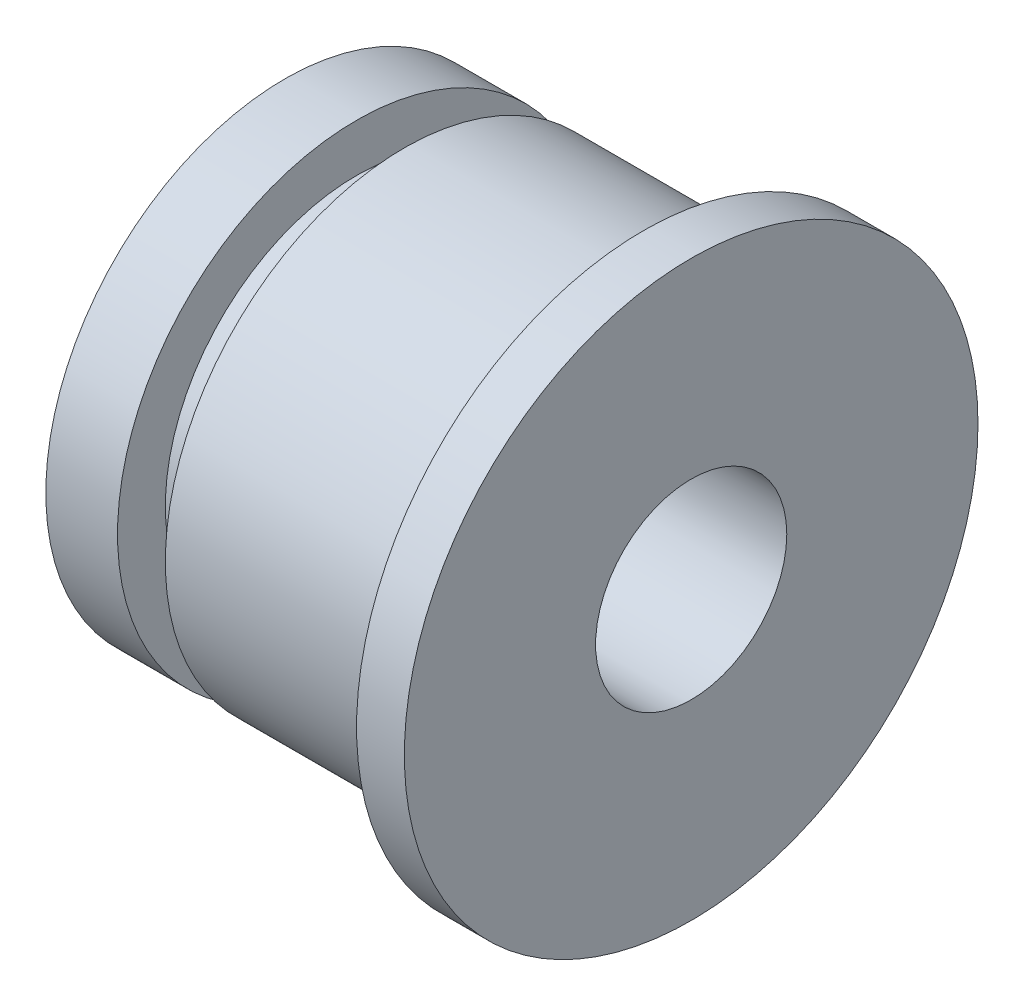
ISO-10303-21;
HEADER;
FILE_DESCRIPTION(('STEP AP214'),'2;1');
FILE_NAME('part.step','',(''),(''),'','','');
FILE_SCHEMA(('AUTOMOTIVE_DESIGN { 1 0 10303 214 1 1 1 1 }'));
ENDSEC;
DATA;
#1=APPLICATION_CONTEXT('core data for automotive mechanical design processes');
#2=APPLICATION_PROTOCOL_DEFINITION('international standard','automotive_design',2000,#1);
#3=PRODUCT_CONTEXT('',#1,'mechanical');
#4=PRODUCT('Part','Part','',(#3));
#5=PRODUCT_RELATED_PRODUCT_CATEGORY('part','',(#4));
#6=PRODUCT_DEFINITION_FORMATION('','',#4);
#7=PRODUCT_DEFINITION_CONTEXT('part definition',#1,'design');
#8=PRODUCT_DEFINITION('design','',#6,#7);
#9=PRODUCT_DEFINITION_SHAPE('','',#8);
#10=(LENGTH_UNIT() NAMED_UNIT(*) SI_UNIT(.MILLI.,.METRE.));
#11=(NAMED_UNIT(*) PLANE_ANGLE_UNIT() SI_UNIT($,.RADIAN.));
#12=(NAMED_UNIT(*) SI_UNIT($,.STERADIAN.) SOLID_ANGLE_UNIT());
#13=UNCERTAINTY_MEASURE_WITH_UNIT(LENGTH_MEASURE(1.E-05),#10,'distance_accuracy_value','');
#14=(GEOMETRIC_REPRESENTATION_CONTEXT(3) GLOBAL_UNCERTAINTY_ASSIGNED_CONTEXT((#13)) GLOBAL_UNIT_ASSIGNED_CONTEXT((#10,
#11,#12)) REPRESENTATION_CONTEXT('',''));
#15=CARTESIAN_POINT('',(0.,0.,0.));
#16=DIRECTION('',(0.,0.,1.));
#17=DIRECTION('',(1.,0.,0.));
#18=AXIS2_PLACEMENT_3D('',#15,#16,#17);
#19=CARTESIAN_POINT('',(11.5,-2.,0.));
#20=DIRECTION('',(1.,0.,0.));
#21=DIRECTION('',(0.,0.,-1.));
#22=AXIS2_PLACEMENT_3D('',#19,#20,#21);
#23=PLANE('',#22);
#24=CARTESIAN_POINT('',(11.5,0.,0.));
#25=DIRECTION('',(1.,0.,0.));
#26=DIRECTION('',(0.,0.,-1.));
#27=AXIS2_PLACEMENT_3D('',#24,#25,#26);
#28=CIRCLE('',#27,5.);
#29=CARTESIAN_POINT('',(11.5,0.,-5.));
#30=VERTEX_POINT('',#29);
#31=EDGE_CURVE('E10',#30,#30,#28,.T.);
#32=ORIENTED_EDGE('',*,*,#31,.F.);
#33=EDGE_LOOP('',(#32));
#34=FACE_BOUND('',#33,.T.);
#35=CARTESIAN_POINT('',(11.5,0.,0.));
#36=DIRECTION('',(1.,0.,0.));
#37=DIRECTION('',(0.,0.,-1.));
#38=AXIS2_PLACEMENT_3D('',#35,#36,#37);
#39=CIRCLE('',#38,2.);
#40=CARTESIAN_POINT('',(11.5,0.,-2.));
#41=VERTEX_POINT('',#40);
#42=EDGE_CURVE('E400',#41,#41,#39,.T.);
#43=ORIENTED_EDGE('',*,*,#42,.T.);
#44=EDGE_LOOP('',(#43));
#45=FACE_BOUND('',#44,.T.);
#46=ADVANCED_FACE('F366',(#34,#45),#23,.F.);
#47=CARTESIAN_POINT('',(23.,0.,0.));
#48=DIRECTION('',(1.,0.,0.));
#49=DIRECTION('',(0.,0.,-1.));
#50=AXIS2_PLACEMENT_3D('',#47,#48,#49);
#51=CYLINDRICAL_SURFACE('',#50,5.);
#52=CARTESIAN_POINT('',(13.,0.,0.));
#53=DIRECTION('',(1.,0.,0.));
#54=DIRECTION('',(0.,0.,-1.));
#55=AXIS2_PLACEMENT_3D('',#52,#53,#54);
#56=CIRCLE('',#55,5.);
#57=CARTESIAN_POINT('',(13.,0.,-5.));
#58=VERTEX_POINT('',#57);
#59=EDGE_CURVE('E372',#58,#58,#56,.T.);
#60=ORIENTED_EDGE('',*,*,#59,.F.);
#61=EDGE_LOOP('',(#60));
#62=FACE_BOUND('',#61,.T.);
#63=ORIENTED_EDGE('',*,*,#31,.T.);
#64=EDGE_LOOP('',(#63));
#65=FACE_BOUND('',#64,.T.);
#66=ADVANCED_FACE('F449',(#62,#65),#51,.T.);
#67=CARTESIAN_POINT('',(13.,-5.,0.));
#68=DIRECTION('',(-1.,0.,0.));
#69=DIRECTION('',(0.,0.,1.));
#70=AXIS2_PLACEMENT_3D('',#67,#68,#69);
#71=PLANE('',#70);
#72=CARTESIAN_POINT('',(13.,0.,0.));
#73=DIRECTION('',(1.,0.,0.));
#74=DIRECTION('',(0.,0.,-1.));
#75=AXIS2_PLACEMENT_3D('',#72,#73,#74);
#76=CIRCLE('',#75,4.);
#77=CARTESIAN_POINT('',(13.,0.,-4.));
#78=VERTEX_POINT('',#77);
#79=EDGE_CURVE('E376',#78,#78,#76,.T.);
#80=ORIENTED_EDGE('',*,*,#79,.F.);
#81=EDGE_LOOP('',(#80));
#82=FACE_BOUND('',#81,.T.);
#83=ORIENTED_EDGE('',*,*,#59,.T.);
#84=EDGE_LOOP('',(#83));
#85=FACE_BOUND('',#84,.T.);
#86=ADVANCED_FACE('F444',(#82,#85),#71,.F.);
#87=CARTESIAN_POINT('',(23.,0.,0.));
#88=DIRECTION('',(1.,0.,0.));
#89=DIRECTION('',(0.,0.,-1.));
#90=AXIS2_PLACEMENT_3D('',#87,#88,#89);
#91=CYLINDRICAL_SURFACE('',#90,4.);
#92=CARTESIAN_POINT('',(14.,0.,0.));
#93=DIRECTION('',(1.,0.,0.));
#94=DIRECTION('',(0.,0.,-1.));
#95=AXIS2_PLACEMENT_3D('',#92,#93,#94);
#96=CIRCLE('',#95,4.);
#97=CARTESIAN_POINT('',(14.,0.,-4.));
#98=VERTEX_POINT('',#97);
#99=EDGE_CURVE('E380',#98,#98,#96,.T.);
#100=ORIENTED_EDGE('',*,*,#99,.F.);
#101=EDGE_LOOP('',(#100));
#102=FACE_BOUND('',#101,.T.);
#103=ORIENTED_EDGE('',*,*,#79,.T.);
#104=EDGE_LOOP('',(#103));
#105=FACE_BOUND('',#104,.T.);
#106=ADVANCED_FACE('F438',(#102,#105),#91,.T.);
#107=CARTESIAN_POINT('',(14.,-4.,0.));
#108=DIRECTION('',(1.,0.,0.));
#109=DIRECTION('',(0.,0.,-1.));
#110=AXIS2_PLACEMENT_3D('',#107,#108,#109);
#111=PLANE('',#110);
#112=CARTESIAN_POINT('',(14.,0.,0.));
#113=DIRECTION('',(1.,0.,0.));
#114=DIRECTION('',(0.,0.,-1.));
#115=AXIS2_PLACEMENT_3D('',#112,#113,#114);
#116=CIRCLE('',#115,5.);
#117=CARTESIAN_POINT('',(14.,0.,-5.));
#118=VERTEX_POINT('',#117);
#119=EDGE_CURVE('E385',#118,#118,#116,.T.);
#120=ORIENTED_EDGE('',*,*,#119,.F.);
#121=EDGE_LOOP('',(#120));
#122=FACE_BOUND('',#121,.T.);
#123=ORIENTED_EDGE('',*,*,#99,.T.);
#124=EDGE_LOOP('',(#123));
#125=FACE_BOUND('',#124,.T.);
#126=ADVANCED_FACE('F432',(#122,#125),#111,.F.);
#127=CARTESIAN_POINT('',(23.,0.,0.));
#128=DIRECTION('',(1.,0.,0.));
#129=DIRECTION('',(0.,0.,-1.));
#130=AXIS2_PLACEMENT_3D('',#127,#128,#129);
#131=CYLINDRICAL_SURFACE('',#130,5.);
#132=CARTESIAN_POINT('',(19.,0.,0.));
#133=DIRECTION('',(1.,0.,0.));
#134=DIRECTION('',(0.,0.,-1.));
#135=AXIS2_PLACEMENT_3D('',#132,#133,#134);
#136=CIRCLE('',#135,5.);
#137=CARTESIAN_POINT('',(19.,0.,-5.));
#138=VERTEX_POINT('',#137);
#139=EDGE_CURVE('E388',#138,#138,#136,.T.);
#140=ORIENTED_EDGE('',*,*,#139,.F.);
#141=EDGE_LOOP('',(#140));
#142=FACE_BOUND('',#141,.T.);
#143=ORIENTED_EDGE('',*,*,#119,.T.);
#144=EDGE_LOOP('',(#143));
#145=FACE_BOUND('',#144,.T.);
#146=ADVANCED_FACE('F426',(#142,#145),#131,.T.);
#147=CARTESIAN_POINT('',(19.,-5.,0.));
#148=DIRECTION('',(1.,0.,0.));
#149=DIRECTION('',(0.,0.,-1.));
#150=AXIS2_PLACEMENT_3D('',#147,#148,#149);
#151=PLANE('',#150);
#152=CARTESIAN_POINT('',(19.,0.,0.));
#153=DIRECTION('',(1.,0.,0.));
#154=DIRECTION('',(0.,0.,-1.));
#155=AXIS2_PLACEMENT_3D('',#152,#153,#154);
#156=CIRCLE('',#155,6.);
#157=CARTESIAN_POINT('',(19.,0.,-6.));
#158=VERTEX_POINT('',#157);
#159=EDGE_CURVE('E391',#158,#158,#156,.T.);
#160=ORIENTED_EDGE('',*,*,#159,.F.);
#161=EDGE_LOOP('',(#160));
#162=FACE_BOUND('',#161,.T.);
#163=ORIENTED_EDGE('',*,*,#139,.T.);
#164=EDGE_LOOP('',(#163));
#165=FACE_BOUND('',#164,.T.);
#166=ADVANCED_FACE('F420',(#162,#165),#151,.F.);
#167=CARTESIAN_POINT('',(23.,0.,0.));
#168=DIRECTION('',(1.,0.,0.));
#169=DIRECTION('',(0.,0.,-1.));
#170=AXIS2_PLACEMENT_3D('',#167,#168,#169);
#171=CYLINDRICAL_SURFACE('',#170,6.);
#172=CARTESIAN_POINT('',(20.,0.,0.));
#173=DIRECTION('',(1.,0.,0.));
#174=DIRECTION('',(0.,0.,-1.));
#175=AXIS2_PLACEMENT_3D('',#172,#173,#174);
#176=CIRCLE('',#175,6.);
#177=CARTESIAN_POINT('',(20.,0.,-6.));
#178=VERTEX_POINT('',#177);
#179=EDGE_CURVE('E394',#178,#178,#176,.T.);
#180=ORIENTED_EDGE('',*,*,#179,.F.);
#181=EDGE_LOOP('',(#180));
#182=FACE_BOUND('',#181,.T.);
#183=ORIENTED_EDGE('',*,*,#159,.T.);
#184=EDGE_LOOP('',(#183));
#185=FACE_BOUND('',#184,.T.);
#186=ADVANCED_FACE('F414',(#182,#185),#171,.T.);
#187=CARTESIAN_POINT('',(20.,-6.,0.));
#188=DIRECTION('',(-1.,0.,0.));
#189=DIRECTION('',(0.,0.,1.));
#190=AXIS2_PLACEMENT_3D('',#187,#188,#189);
#191=PLANE('',#190);
#192=CARTESIAN_POINT('',(20.,0.,0.));
#193=DIRECTION('',(1.,0.,0.));
#194=DIRECTION('',(0.,0.,-1.));
#195=AXIS2_PLACEMENT_3D('',#192,#193,#194);
#196=CIRCLE('',#195,2.);
#197=CARTESIAN_POINT('',(20.,0.,-2.));
#198=VERTEX_POINT('',#197);
#199=EDGE_CURVE('E397',#198,#198,#196,.T.);
#200=ORIENTED_EDGE('',*,*,#199,.F.);
#201=EDGE_LOOP('',(#200));
#202=FACE_BOUND('',#201,.T.);
#203=ORIENTED_EDGE('',*,*,#179,.T.);
#204=EDGE_LOOP('',(#203));
#205=FACE_BOUND('',#204,.T.);
#206=ADVANCED_FACE('F408',(#202,#205),#191,.F.);
#207=CARTESIAN_POINT('',(23.,0.,0.));
#208=DIRECTION('',(1.,0.,0.));
#209=DIRECTION('',(0.,0.,-1.));
#210=AXIS2_PLACEMENT_3D('',#207,#208,#209);
#211=CYLINDRICAL_SURFACE('',#210,2.);
#212=ORIENTED_EDGE('',*,*,#42,.F.);
#213=EDGE_LOOP('',(#212));
#214=FACE_BOUND('',#213,.T.);
#215=ORIENTED_EDGE('',*,*,#199,.T.);
#216=EDGE_LOOP('',(#215));
#217=FACE_BOUND('',#216,.T.);
#218=ADVANCED_FACE('F405',(#214,#217),#211,.F.);
#219=CLOSED_SHELL('',(#46,#66,#86,#106,#126,#146,#166,#186,#206,#218));
#220=MANIFOLD_SOLID_BREP('B2',#219);
#221=ADVANCED_BREP_SHAPE_REPRESENTATION('',(#18,#220),#14);
#222=SHAPE_DEFINITION_REPRESENTATION(#9,#221);
ENDSEC;
END-ISO-10303-21;
